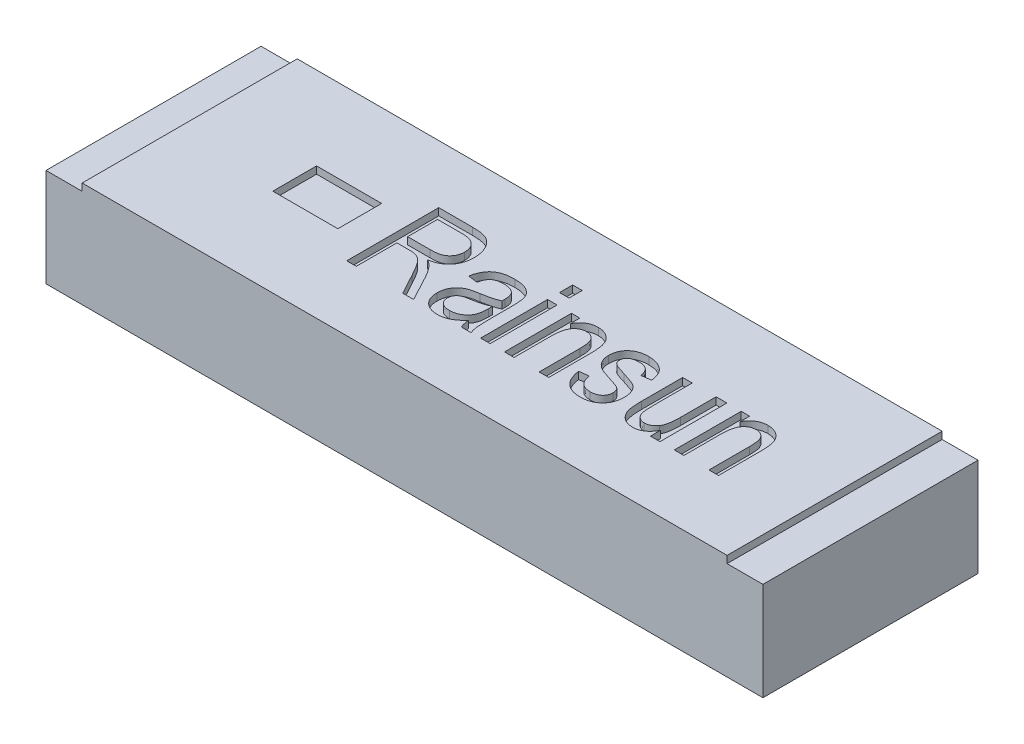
from build123d import *

# Parameters (mm, degrees)
ESQUISSE1_W             = 10
ESQUISSE1_H             = 3
BOSS_EXTRU_1_DEPTH      = 1.47
ESQUISSE2_W             = 0.907288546
ESQUISSE2_H             = 0.61051192
ENL_V_MAT_EXTRU_1_DEPTH = 0.1
ESQUISSE3_W             = 0.504272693
ESQUISSE3_H             = 3
ESQUISSE3_W_2           = 0.500030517
ENL_V_MAT_EXTRU_2_DEPTH = 0.1
ESQUISSE4_W             = 0.133419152
ESQUISSE4_H             = 0.183451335
ESQUISSE4_H_2           = 0.933934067
ENL_V_MAT_EXTRU_3_DEPTH = 0.1


with BuildPart() as part:
    # Esquisse1 → Boss.-Extru.1 (new body)
    with BuildSketch(Plane(origin=(0, 0, 0), x_dir=(1, 0, 0), z_dir=(0, 1, 0))):
        Rectangle(ESQUISSE1_W, ESQUISSE1_H)
    extrude(amount=BOSS_EXTRU_1_DEPTH)

    # Esquisse2 → Enl_v. mat.-Extru.1 (cut)
    with BuildSketch(Plane(origin=(0, 1.47, 0), x_dir=(1, 0, 0), z_dir=(0, 1, 0))):
        with Locations((-2.613912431, 0.036415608)):
            Rectangle(ESQUISSE2_W, ESQUISSE2_H)
    extrude(amount=-ENL_V_MAT_EXTRU_1_DEPTH, mode=Mode.SUBTRACT)

    # Esquisse3 → Enl_v. mat.-Extru.2 (cut)
    with BuildSketch(Plane(origin=(0, 1.47, 0), x_dir=(1, 0, 0), z_dir=(0, 1, 0))):
        with Locations((-4.747863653, 0)):
            Rectangle(ESQUISSE3_W, ESQUISSE3_H)
        with Locations((4.749984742, 0)):
            Rectangle(ESQUISSE3_W_2, ESQUISSE3_H)
    extrude(amount=-ENL_V_MAT_EXTRU_2_DEPTH, mode=Mode.SUBTRACT)

    # Esquisse4 → Enl_v. mat.-Extru.3 (cut)
    # profile 1 of 8: a face of its own
    with BuildSketch(Plane(origin=(0, 1.47, 0), x_dir=(1, 0, 0), z_dir=(0, 1, 0))):
        with BuildLine():
            Line((-1.711203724, -0.594725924), (-1.711203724, 0.689433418))
            Line((-1.711203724, 0.689433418), (-1.239546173, 0.689433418))
            add(Edge.make_bspline(
                [(-1.239546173, 0.689433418), (-1.227643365, 0.689364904), (-1.204604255, 0.689232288), (-1.171228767, 0.687324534), (-1.14019478, 0.684500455), (-1.11154364, 0.68074553), (-1.085442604, 0.675539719), (-1.061788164, 0.669224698), (-1.040387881, 0.662175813), (-1.015264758, 0.650548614), (-0.986602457, 0.632513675), (-0.955690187, 0.605036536), (-0.928613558, 0.571009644), (-0.904519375, 0.53191409), (-0.884732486, 0.488019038), (-0.870716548, 0.440148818), (-0.862255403, 0.388932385), (-0.861198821, 0.353660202), (-0.860656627, 0.335559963)],
                knots=[0, 0, 0, 0, 0.957775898, 1.853873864, 2.6892683, 3.465319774, 4.178195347, 4.829309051, 5.435011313, 5.988660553, 7.053440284, 8.147710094, 9.30058322, 10.540256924, 11.835580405, 13.162637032, 14.543981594, 16, 16, 16, 16], degree=3))
            add(Edge.make_bspline(
                [(-0.860656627, 0.335559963), (-0.860940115, 0.323565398), (-0.861493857, 0.300136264), (-0.864848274, 0.265796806), (-0.870677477, 0.233224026), (-0.879592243, 0.202502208), (-0.889931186, 0.173249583), (-0.903507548, 0.14597893), (-0.919083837, 0.120338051), (-0.937187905, 0.096530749), (-0.95743797, 0.07461011), (-0.980164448, 0.054920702), (-1.004925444, 0.037182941), (-1.031914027, 0.021552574), (-1.060963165, 0.007829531), (-1.092416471, -0.003120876), (-1.125783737, -0.012710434), (-1.148993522, -0.017108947), (-1.16084972, -0.01935583)],
                knots=[0, 0, 0, 0, 1.121977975, 2.191573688, 3.224240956, 4.211948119, 5.180998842, 6.122125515, 7.055751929, 7.983633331, 8.914994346, 9.842128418, 10.791356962, 11.759862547, 12.75578979, 13.791489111, 14.871831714, 16, 16, 16, 16], degree=3))
            add(Edge.make_bspline(
                [(-1.16084972, -0.01935583), (-1.15209864, -0.02419759), (-1.13543998, -0.033414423), (-1.112641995, -0.0482849), (-1.093158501, -0.063252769), (-1.082144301, -0.074145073), (-1.076941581, -0.079290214)],
                knots=[0, 0, 0, 0, 1.158843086, 2.205987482, 3.152571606, 4, 4, 4, 4], degree=3))
            add(Edge.make_bspline(
                [(-1.076941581, -0.079290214), (-1.066535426, -0.091850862), (-1.045606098, -0.117113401), (-1.01691532, -0.157416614), (-0.989433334, -0.199343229), (-0.973294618, -0.228836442), (-0.965150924, -0.243718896)],
                knots=[0, 0, 0, 0, 0.982253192, 1.975551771, 2.978451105, 4, 4, 4, 4], degree=3))
            Line((-0.965150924, -0.243718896), (-0.777269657, -0.594725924))
            Line((-0.777269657, -0.594725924), (-0.928929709, -0.594725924))
            Line((-0.928929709, -0.594725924), (-1.077202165, -0.320070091))
            add(Edge.make_bspline(
                [(-1.077202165, -0.320070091), (-1.084109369, -0.307191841), (-1.0973212, -0.282558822), (-1.116928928, -0.247583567), (-1.135155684, -0.216041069), (-1.151970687, -0.187900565), (-1.167623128, -0.163460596), (-1.1816813, -0.142385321), (-1.194555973, -0.124914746), (-1.209964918, -0.106914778), (-1.227875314, -0.088255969), (-1.249166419, -0.069516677), (-1.270432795, -0.054989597), (-1.292084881, -0.043926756), (-1.315919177, -0.036638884), (-1.342775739, -0.031183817), (-1.373855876, -0.028216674), (-1.395890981, -0.027875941), (-1.407623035, -0.027694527)],
                knots=[0, 0, 0, 0, 1.483643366, 2.83785556, 4.070616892, 5.1822306, 6.165666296, 7.016844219, 7.754091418, 8.367230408, 9.421242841, 10.377779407, 11.241203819, 12.029974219, 12.835959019, 13.762973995, 14.808950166, 16, 16, 16, 16], degree=3))
            Line((-1.407623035, -0.027694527), (-1.577784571, -0.027694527))
            Line((-1.577784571, -0.027694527), (-1.577784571, -0.594725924))
            Line((-1.577784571, -0.594725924), (-1.711203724, -0.594725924))
        make_face()
        with BuildLine():
            Line((-1.577784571, 0.12240202), (-1.264822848, 0.12240202))
            add(Edge.make_bspline(
                [(-1.264822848, 0.12240202), (-1.248745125, 0.122715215), (-1.218613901, 0.123302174), (-1.176460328, 0.127200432), (-1.140481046, 0.134254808), (-1.110003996, 0.144529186), (-1.084015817, 0.158143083), (-1.061389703, 0.175001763), (-1.041543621, 0.195135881), (-1.02466241, 0.21842467), (-1.010704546, 0.244359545), (-1.001284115, 0.272869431), (-0.994889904, 0.303137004), (-0.994351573, 0.324059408), (-0.994075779, 0.33477821)],
                knots=[0, 0, 0, 0, 1.47306528, 2.760668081, 3.873497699, 4.82484281, 5.696997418, 6.550136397, 7.399890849, 8.276969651, 9.17766846, 10.086208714, 11.019541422, 12, 12, 12, 12], degree=3))
            add(Edge.make_bspline(
                [(-0.994075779, 0.33477821), (-0.994316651, 0.342513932), (-0.994786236, 0.357594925), (-0.997256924, 0.379626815), (-1.002078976, 0.400359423), (-1.008441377, 0.41990416), (-1.016995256, 0.438082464), (-1.026984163, 0.455181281), (-1.039564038, 0.470497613), (-1.053253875, 0.484997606), (-1.069096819, 0.497870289), (-1.086789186, 0.50902418), (-1.106327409, 0.51839365), (-1.127523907, 0.526427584), (-1.15080889, 0.531771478), (-1.175636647, 0.53639986), (-1.202315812, 0.538965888), (-1.22069229, 0.539210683), (-1.230165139, 0.539336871)],
                knots=[0, 0, 0, 0, 1.045235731, 2.037714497, 2.988326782, 3.915852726, 4.808207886, 5.697550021, 6.58254782, 7.478674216, 8.387536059, 9.331464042, 10.296946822, 11.310355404, 12.385965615, 13.518246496, 14.720686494, 16, 16, 16, 16], degree=3))
            Line((-1.230165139, 0.539336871), (-1.577784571, 0.539336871))
            Line((-1.577784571, 0.539336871), (-1.577784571, 0.12240202))
        make_face(mode=Mode.SUBTRACT)
    # profile 2 of 8: a face of its own
    with BuildSketch(Plane(origin=(0, 1.47, 0), x_dir=(1, 0, 0), z_dir=(0, 1, 0))):
        with BuildLine():
            add(Edge.make_bspline(
                [(-0.143528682, -0.465997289), (-0.154468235, -0.477471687), (-0.175736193, -0.499779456), (-0.209803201, -0.52937873), (-0.244547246, -0.554585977), (-0.280014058, -0.575345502), (-0.316234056, -0.59134839), (-0.352977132, -0.603013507), (-0.39055834, -0.60999292), (-0.41589769, -0.610932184), (-0.428607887, -0.611403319)],
                knots=[0, 0, 0, 0, 1.153539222, 2.242634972, 3.279759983, 4.274221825, 5.22822196, 6.156113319, 7.075107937, 8, 8, 8, 8], degree=3))
            add(Edge.make_bspline(
                [(-0.428607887, -0.611403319), (-0.438435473, -0.611242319), (-0.457631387, -0.610927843), (-0.485672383, -0.607324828), (-0.512265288, -0.602103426), (-0.537233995, -0.594068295), (-0.560835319, -0.584298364), (-0.582766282, -0.571908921), (-0.603314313, -0.557550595), (-0.621971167, -0.540807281), (-0.638970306, -0.522412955), (-0.653606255, -0.502129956), (-0.666218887, -0.480450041), (-0.676425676, -0.457100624), (-0.684130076, -0.432240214), (-0.689970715, -0.405941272), (-0.69335696, -0.378096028), (-0.693705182, -0.358993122), (-0.693882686, -0.349255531)],
                knots=[0, 0, 0, 0, 1.119001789, 2.185711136, 3.216323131, 4.202252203, 5.169072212, 6.121655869, 7.066185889, 8.01954035, 8.972175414, 9.914421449, 10.863296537, 11.8249363, 12.810865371, 13.824179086, 14.890888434, 16, 16, 16, 16], degree=3))
            add(Edge.make_bspline(
                [(-0.693882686, -0.349255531), (-0.69353742, -0.336281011), (-0.692865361, -0.311026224), (-0.686023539, -0.274374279), (-0.675499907, -0.239930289), (-0.660208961, -0.208004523), (-0.641295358, -0.17897671), (-0.619104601, -0.15296628), (-0.593649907, -0.130471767), (-0.569800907, -0.114444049), (-0.548603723, -0.103328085), (-0.530619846, -0.095609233), (-0.510774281, -0.088351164), (-0.489078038, -0.081486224), (-0.465358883, -0.075657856), (-0.43972935, -0.070149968), (-0.412172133, -0.065230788), (-0.393090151, -0.062470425), (-0.383266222, -0.061049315)],
                knots=[0, 0, 0, 0, 1.315736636, 2.561069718, 3.771447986, 4.962594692, 6.141438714, 7.279577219, 8.422657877, 9.579430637, 10.186831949, 10.850275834, 11.564458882, 12.331400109, 13.159047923, 14.042804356, 14.992381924, 16, 16, 16, 16], degree=3))
            add(Edge.make_bspline(
                [(-0.383266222, -0.061049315), (-0.370047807, -0.058786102), (-0.344503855, -0.054412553), (-0.307787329, -0.046752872), (-0.27368278, -0.039022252), (-0.242451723, -0.030660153), (-0.213693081, -0.022397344), (-0.187816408, -0.013536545), (-0.164443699, -0.004645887), (-0.150258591, 0.002344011), (-0.143528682, 0.005660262)],
                knots=[0, 0, 0, 0, 1.28905306, 2.491033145, 3.605049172, 4.650122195, 5.598672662, 6.480605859, 7.279146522, 8, 8, 8, 8], degree=3))
            Line((-0.143528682, 0.005660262), (-0.143528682, 0.043705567))
            add(Edge.make_bspline(
                [(-0.143528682, 0.043705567), (-0.143584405, 0.050921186), (-0.143691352, 0.06476992), (-0.145728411, 0.084666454), (-0.148127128, 0.102996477), (-0.151939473, 0.119709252), (-0.157304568, 0.134611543), (-0.163181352, 0.14811235), (-0.170397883, 0.159944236), (-0.176349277, 0.166605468), (-0.179228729, 0.169828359)],
                knots=[0, 0, 0, 0, 1.290137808, 2.476124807, 3.574920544, 4.596386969, 5.535069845, 6.404438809, 7.22802268, 8, 8, 8, 8], degree=3))
            add(Edge.make_bspline(
                [(-0.179228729, 0.169828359), (-0.183551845, 0.174035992), (-0.192302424, 0.182552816), (-0.207658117, 0.193201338), (-0.22465146, 0.202290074), (-0.243224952, 0.209889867), (-0.263497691, 0.215667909), (-0.285535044, 0.219330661), (-0.30918883, 0.222149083), (-0.325580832, 0.222358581), (-0.334015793, 0.222466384)],
                knots=[0, 0, 0, 0, 0.860333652, 1.741433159, 2.657216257, 3.608602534, 4.602004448, 5.660502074, 6.796146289, 8, 8, 8, 8], degree=3))
            add(Edge.make_bspline(
                [(-0.334015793, 0.222466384), (-0.348817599, 0.222190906), (-0.376517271, 0.221675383), (-0.415160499, 0.214715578), (-0.448175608, 0.204251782), (-0.471476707, 0.190965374), (-0.48692811, 0.177613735), (-0.497571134, 0.165934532), (-0.507214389, 0.152197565), (-0.516075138, 0.136619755), (-0.524454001, 0.119273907), (-0.531593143, 0.099726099), (-0.538512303, 0.07850157), (-0.541991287, 0.063455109), (-0.54378614, 0.055692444)],
                knots=[0, 0, 0, 0, 1.779102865, 3.329361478, 4.707868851, 5.930643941, 6.523657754, 7.16004944, 7.827207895, 8.539060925, 9.31524689, 10.142348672, 11.041613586, 12, 12, 12, 12], degree=3))
            Line((-0.54378614, 0.055692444), (-0.677205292, 0.072369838))
            add(Edge.make_bspline(
                [(-0.677205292, 0.072369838), (-0.6746457, 0.084300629), (-0.669658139, 0.107548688), (-0.660153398, 0.141011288), (-0.648322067, 0.171891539), (-0.634906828, 0.200270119), (-0.619638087, 0.226082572), (-0.602772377, 0.249516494), (-0.58354256, 0.270061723), (-0.562850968, 0.288609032), (-0.539832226, 0.304665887), (-0.514566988, 0.318447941), (-0.486876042, 0.329827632), (-0.457150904, 0.339627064), (-0.424892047, 0.346662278), (-0.390468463, 0.352269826), (-0.353614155, 0.355303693), (-0.328287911, 0.355687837), (-0.315253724, 0.355885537)],
                knots=[0, 0, 0, 0, 1.146744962, 2.234520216, 3.265547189, 4.251500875, 5.181194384, 6.080940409, 6.959092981, 7.820811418, 8.688273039, 9.590681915, 10.520124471, 11.498613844, 12.528476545, 13.619677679, 14.774963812, 16, 16, 16, 16], degree=3))
            add(Edge.make_bspline(
                [(-0.315253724, 0.355885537), (-0.305086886, 0.35572767), (-0.285339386, 0.355421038), (-0.25655435, 0.35327447), (-0.229467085, 0.350024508), (-0.204018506, 0.345109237), (-0.180337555, 0.338453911), (-0.158077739, 0.331103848), (-0.137620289, 0.321981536), (-0.113455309, 0.307848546), (-0.086878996, 0.288215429), (-0.060184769, 0.261680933), (-0.040645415, 0.231700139), (-0.029900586, 0.204429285), (-0.024183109, 0.180956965), (-0.02023026, 0.161499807), (-0.017214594, 0.139993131), (-0.014621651, 0.116616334), (-0.012584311, 0.091327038), (-0.010957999, 0.064224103), (-0.010267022, 0.035196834), (-0.010163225, 0.015215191), (-0.01010953, 0.004878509)],
                knots=[0, 0, 0, 0, 1.116479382, 2.168587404, 3.16840818, 4.111316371, 5.011567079, 5.868311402, 6.683862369, 7.465978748, 8.938885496, 10.301521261, 11.576846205, 12.839874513, 13.499268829, 14.228894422, 15.019458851, 15.883290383, 16.811756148, 17.805505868, 18.864768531, 20, 20, 20, 20], degree=3))
            Line((-0.01010953, 0.004878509), (-0.01010953, -0.205152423))
            add(Edge.make_bspline(
                [(-0.01010953, -0.205152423), (-0.010165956, -0.222698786), (-0.010273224, -0.256055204), (-0.009554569, -0.303565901), (-0.009212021, -0.345958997), (-0.008262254, -0.38330379), (-0.007758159, -0.415546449), (-0.006280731, -0.442635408), (-0.005145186, -0.464632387), (-0.002217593, -0.496631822), (0.005573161, -0.540065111), (0.017356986, -0.576513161), (0.023245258, -0.594725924)],
                knots=[0, 0, 0, 0, 1.33924071, 2.545956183, 3.626711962, 4.574996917, 5.397345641, 6.087652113, 6.645549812, 7.078325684, 8.540065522, 10, 10, 10, 10], degree=3))
            Line((0.023245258, -0.594725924), (-0.110173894, -0.594725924))
            add(Edge.make_bspline(
                [(-0.110173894, -0.594725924), (-0.114280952, -0.585332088), (-0.12268473, -0.566110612), (-0.1318327, -0.534934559), (-0.139253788, -0.501427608), (-0.14207839, -0.478017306), (-0.143528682, -0.465997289)],
                knots=[0, 0, 0, 0, 0.920202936, 1.882900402, 2.912975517, 4, 4, 4, 4], degree=3))
        make_face()
        with BuildLine():
            add(Edge.make_bspline(
                [(-0.143528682, -0.127758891), (-0.150187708, -0.131035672), (-0.164042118, -0.137853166), (-0.186282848, -0.147228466), (-0.210815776, -0.156083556), (-0.237782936, -0.164241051), (-0.266890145, -0.172723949), (-0.298383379, -0.180425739), (-0.332115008, -0.187720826), (-0.35537379, -0.192172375), (-0.367370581, -0.194468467)],
                knots=[0, 0, 0, 0, 0.759937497, 1.581085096, 2.470290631, 3.429739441, 4.465916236, 5.57487507, 6.749129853, 8, 8, 8, 8], degree=3))
            add(Edge.make_bspline(
                [(-0.367370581, -0.194468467), (-0.380675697, -0.196633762), (-0.405196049, -0.200624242), (-0.438780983, -0.207432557), (-0.465801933, -0.215072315), (-0.487231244, -0.223244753), (-0.504266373, -0.232849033), (-0.51874445, -0.243886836), (-0.531409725, -0.25670757), (-0.541775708, -0.271407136), (-0.5501675, -0.2873274), (-0.556316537, -0.304491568), (-0.559604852, -0.322898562), (-0.560173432, -0.335519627), (-0.560463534, -0.341959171)],
                knots=[0, 0, 0, 0, 1.792080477, 3.302672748, 4.55256871, 5.521793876, 6.343933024, 7.143043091, 7.93511388, 8.729789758, 9.525220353, 10.321404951, 11.1435441, 12, 12, 12, 12], degree=3))
            add(Edge.make_bspline(
                [(-0.560463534, -0.341959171), (-0.560074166, -0.351851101), (-0.559324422, -0.37089845), (-0.550350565, -0.397752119), (-0.536790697, -0.421748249), (-0.517264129, -0.442032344), (-0.493026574, -0.458322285), (-0.464218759, -0.469679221), (-0.43147505, -0.4768459), (-0.408236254, -0.477592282), (-0.396034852, -0.477984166)],
                knots=[0, 0, 0, 0, 0.982989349, 1.89278952, 2.793465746, 3.712871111, 4.674195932, 5.684718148, 6.784373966, 8, 8, 8, 8], degree=3))
            add(Edge.make_bspline(
                [(-0.396034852, -0.477984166), (-0.384101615, -0.477623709), (-0.360571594, -0.476912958), (-0.326178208, -0.470059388), (-0.293309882, -0.459503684), (-0.262653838, -0.444260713), (-0.234600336, -0.425737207), (-0.210067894, -0.403841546), (-0.189236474, -0.379175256), (-0.175139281, -0.356030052), (-0.165820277, -0.335740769), (-0.159823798, -0.318725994), (-0.155085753, -0.300090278), (-0.150372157, -0.280014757), (-0.147554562, -0.258095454), (-0.145083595, -0.234647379), (-0.143883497, -0.209507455), (-0.14364965, -0.192210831), (-0.143528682, -0.183263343)],
                knots=[0, 0, 0, 0, 1.295816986, 2.555099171, 3.797272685, 5.038800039, 6.264426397, 7.441439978, 8.600861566, 9.761973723, 10.374641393, 11.025690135, 11.719692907, 12.46426932, 13.265486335, 14.119543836, 15.027246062, 16, 16, 16, 16], degree=3))
            Line((-0.143528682, -0.183263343), (-0.143528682, -0.127758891))
        make_face(mode=Mode.SUBTRACT)
    # profile 3 of 8: a face of its own
    with BuildSketch(Plane(origin=(0, 1.47, 0), x_dir=(1, 0, 0), z_dir=(0, 1, 0))):
        with Locations((0.223373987, 0.597707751)):
            Rectangle(ESQUISSE4_W, ESQUISSE4_H)
    # profile 4 of 8: a face of its own
    with BuildSketch(Plane(origin=(0, 1.47, 0), x_dir=(1, 0, 0), z_dir=(0, 1, 0))):
        with Locations((0.223373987, -0.12775889)):
            Rectangle(ESQUISSE4_W, ESQUISSE4_H_2)
    # profile 5 of 8: a face of its own
    with BuildSketch(Plane(origin=(0, 1.47, 0), x_dir=(1, 0, 0), z_dir=(0, 1, 0))):
        with BuildLine():
            Line((0.490212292, -0.594725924), (0.490212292, 0.339208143))
            Line((0.490212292, 0.339208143), (0.60695405, 0.339208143))
            Line((0.60695405, 0.339208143), (0.60695405, 0.20578899))
            add(Edge.make_bspline(
                [(0.60695405, 0.20578899), (0.61406544, 0.217781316), (0.627804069, 0.240949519), (0.652324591, 0.271869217), (0.679291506, 0.297829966), (0.708494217, 0.319268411), (0.740056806, 0.335971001), (0.774157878, 0.347305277), (0.81033198, 0.354632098), (0.835276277, 0.355462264), (0.847994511, 0.355885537)],
                knots=[0, 0, 0, 0, 1.116801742, 2.157570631, 3.152411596, 4.109288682, 5.053077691, 6.00219512, 6.981388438, 8, 8, 8, 8], degree=3))
            add(Edge.make_bspline(
                [(0.847994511, 0.355885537), (0.858000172, 0.355575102), (0.877676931, 0.354964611), (0.906616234, 0.350426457), (0.93436821, 0.342933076), (0.960633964, 0.332113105), (0.985089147, 0.319203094), (1.007705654, 0.304700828), (1.027130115, 0.287496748), (1.044770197, 0.268902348), (1.059714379, 0.247571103), (1.07295214, 0.223754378), (1.083360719, 0.196635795), (1.090743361, 0.172135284), (1.095621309, 0.15038025), (1.098523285, 0.131726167), (1.101626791, 0.111005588), (1.103390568, 0.088186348), (1.1054636, 0.063366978), (1.106243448, 0.036410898), (1.107168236, 0.007403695), (1.10723928, -0.01266646), (1.107275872, -0.023004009)],
                knots=[0, 0, 0, 0, 1.141513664, 2.244858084, 3.334220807, 4.4147531, 5.47892906, 6.48793521, 7.471744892, 8.432665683, 9.406385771, 10.43563962, 11.534566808, 12.713805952, 13.353541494, 14.077102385, 14.86776246, 15.743679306, 16.687940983, 17.709721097, 18.820344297, 20, 20, 20, 20], degree=3))
            Line((1.107275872, -0.023004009), (1.107275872, -0.594725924))
            Line((1.107275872, -0.594725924), (0.973856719, -0.594725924))
            Line((0.973856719, -0.594725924), (0.973856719, -0.027173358))
            add(Edge.make_bspline(
                [(0.973856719, -0.027173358), (0.973675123, -0.011187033), (0.973337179, 0.018562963), (0.970477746, 0.059782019), (0.965140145, 0.094045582), (0.957975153, 0.122248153), (0.947981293, 0.145404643), (0.935921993, 0.165356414), (0.92114596, 0.182456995), (0.904136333, 0.19680524), (0.885389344, 0.208396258), (0.864921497, 0.216510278), (0.84312684, 0.221683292), (0.828045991, 0.222202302), (0.820372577, 0.222466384)],
                knots=[0, 0, 0, 0, 1.730600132, 3.220586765, 4.468134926, 5.480892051, 6.361235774, 7.188558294, 7.99531897, 8.795973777, 9.589417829, 10.369941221, 11.170596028, 12, 12, 12, 12], degree=3))
            add(Edge.make_bspline(
                [(0.820372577, 0.222466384), (0.81306168, 0.222297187), (0.798704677, 0.221964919), (0.77782421, 0.218441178), (0.758061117, 0.212979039), (0.739451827, 0.2053407), (0.721811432, 0.195754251), (0.705627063, 0.183516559), (0.690337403, 0.169437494), (0.676540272, 0.152816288), (0.663698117, 0.13378884), (0.652923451, 0.111558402), (0.643861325, 0.086277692), (0.636300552, 0.058050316), (0.630733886, 0.026649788), (0.62664417, -0.007803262), (0.623961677, -0.045372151), (0.623744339, -0.071467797), (0.623631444, -0.085023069)],
                knots=[0, 0, 0, 0, 0.848519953, 1.666307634, 2.452162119, 3.226006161, 3.998269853, 4.777227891, 5.576824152, 6.40751938, 7.280639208, 8.237274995, 9.268282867, 10.396604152, 11.627583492, 12.969211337, 14.425669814, 16, 16, 16, 16], degree=3))
            Line((0.623631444, -0.085023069), (0.623631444, -0.594725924))
            Line((0.623631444, -0.594725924), (0.490212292, -0.594725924))
        make_face()
    # profile 6 of 8: a face of its own
    with BuildSketch(Plane(origin=(0, 1.47, 0), x_dir=(1, 0, 0), z_dir=(0, 1, 0))):
        with BuildLine():
            Line((1.240695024, -0.311210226), (1.374114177, -0.294532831))
            add(Edge.make_bspline(
                [(1.374114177, -0.294532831), (1.376371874, -0.309134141), (1.380651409, -0.336811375), (1.393510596, -0.375020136), (1.4111472, -0.407433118), (1.434135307, -0.433748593), (1.461810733, -0.453874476), (1.493697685, -0.468017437), (1.529597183, -0.476475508), (1.554824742, -0.477466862), (1.567988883, -0.477984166)],
                knots=[0, 0, 0, 0, 1.189281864, 2.254320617, 3.232274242, 4.145201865, 5.047107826, 5.968481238, 6.939921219, 8, 8, 8, 8], degree=3))
            add(Edge.make_bspline(
                [(1.567988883, -0.477984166), (1.581060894, -0.477529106), (1.605799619, -0.476667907), (1.640667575, -0.469049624), (1.671027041, -0.45643928), (1.696100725, -0.438060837), (1.716022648, -0.416069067), (1.730901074, -0.391108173), (1.739430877, -0.362910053), (1.740477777, -0.343231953), (1.741016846, -0.333099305)],
                knots=[0, 0, 0, 0, 1.234162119, 2.335646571, 3.354322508, 4.318233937, 5.248195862, 6.142280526, 7.043423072, 8, 8, 8, 8], degree=3))
            add(Edge.make_bspline(
                [(1.741016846, -0.333099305), (1.740730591, -0.3244613), (1.740185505, -0.308012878), (1.734350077, -0.284893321), (1.724714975, -0.264653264), (1.715222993, -0.25378473), (1.710528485, -0.248409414)],
                knots=[0, 0, 0, 0, 1.120009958, 2.132714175, 3.076485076, 4, 4, 4, 4], degree=3))
            add(Edge.make_bspline(
                [(1.710528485, -0.248409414), (1.708398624, -0.246614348), (1.703462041, -0.242453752), (1.694034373, -0.237026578), (1.682233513, -0.230979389), (1.667778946, -0.224725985), (1.650630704, -0.218430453), (1.631002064, -0.211215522), (1.608704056, -0.204076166), (1.592925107, -0.199308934), (1.584666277, -0.196813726)],
                knots=[0, 0, 0, 0, 0.488033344, 1.131161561, 1.901529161, 2.816272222, 3.89210763, 5.107205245, 6.485887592, 8, 8, 8, 8], degree=3))
            add(Edge.make_bspline(
                [(1.584666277, -0.196813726), (1.572494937, -0.193113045), (1.549153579, -0.186016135), (1.51573333, -0.175257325), (1.485254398, -0.165225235), (1.457786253, -0.15533877), (1.433397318, -0.14558622), (1.411633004, -0.13686609), (1.392877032, -0.128372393), (1.372219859, -0.117380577), (1.349636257, -0.102609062), (1.325789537, -0.082297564), (1.305299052, -0.059064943), (1.28794248, -0.033486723), (1.274466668, -0.005425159), (1.264331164, 0.02453576), (1.258675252, 0.056523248), (1.257811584, 0.078429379), (1.257372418, 0.0895684)],
                knots=[0, 0, 0, 0, 1.285567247, 2.465372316, 3.547942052, 4.528124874, 5.414867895, 6.202193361, 6.897424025, 7.494322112, 8.565551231, 9.617619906, 10.649836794, 11.686968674, 12.731245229, 13.786056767, 14.87423479, 16, 16, 16, 16], degree=3))
            add(Edge.make_bspline(
                [(1.257372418, 0.0895684), (1.25762462, 0.099222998), (1.258117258, 0.118081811), (1.261924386, 0.145721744), (1.267756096, 0.172052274), (1.276360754, 0.197003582), (1.287787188, 0.220246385), (1.301054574, 0.242411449), (1.317110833, 0.263087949), (1.335579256, 0.28224721), (1.356017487, 0.299780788), (1.378791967, 0.314705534), (1.403300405, 0.327507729), (1.429778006, 0.337924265), (1.458055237, 0.346025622), (1.488168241, 0.351584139), (1.520113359, 0.355486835), (1.542091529, 0.355750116), (1.553396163, 0.355885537)],
                knots=[0, 0, 0, 0, 1.030981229, 2.013867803, 2.975009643, 3.908154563, 4.825293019, 5.737112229, 6.663218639, 7.614772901, 8.57591474, 9.533242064, 10.516829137, 11.524797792, 12.56736321, 13.653765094, 14.793196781, 16, 16, 16, 16], degree=3))
            add(Edge.make_bspline(
                [(1.553396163, 0.355885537), (1.567572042, 0.355456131), (1.595174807, 0.354620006), (1.635255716, 0.348980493), (1.672664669, 0.338977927), (1.707160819, 0.325222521), (1.738571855, 0.308388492), (1.766169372, 0.288474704), (1.789892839, 0.265894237), (1.810093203, 0.240243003), (1.826497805, 0.210084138), (1.839837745, 0.174810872), (1.850826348, 0.133964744), (1.855363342, 0.10456732), (1.857758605, 0.089047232)],
                knots=[0, 0, 0, 0, 1.129175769, 2.198690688, 3.215779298, 4.206399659, 5.150677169, 6.047525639, 6.908839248, 7.7517529, 8.637509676, 9.632036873, 10.749856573, 12, 12, 12, 12], degree=3))
            Line((1.857758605, 0.089047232), (1.724339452, 0.072369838))
            add(Edge.make_bspline(
                [(1.724339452, 0.072369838), (1.722511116, 0.084166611), (1.719036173, 0.106587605), (1.708692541, 0.137725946), (1.693617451, 0.163881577), (1.674808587, 0.185835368), (1.651269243, 0.202417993), (1.623778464, 0.214249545), (1.592225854, 0.221308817), (1.569851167, 0.222067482), (1.55808668, 0.222466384)],
                knots=[0, 0, 0, 0, 1.1431212, 2.172620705, 3.123755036, 4.020570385, 4.921665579, 5.857517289, 6.873494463, 8, 8, 8, 8], degree=3))
            add(Edge.make_bspline(
                [(1.55808668, 0.222466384), (1.544855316, 0.222109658), (1.520062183, 0.22144122), (1.485492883, 0.21547045), (1.45596182, 0.205929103), (1.432025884, 0.191694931), (1.413671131, 0.174236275), (1.400449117, 0.154404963), (1.39215467, 0.132146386), (1.391253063, 0.116393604), (1.390791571, 0.108330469)],
                knots=[0, 0, 0, 0, 1.395580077, 2.6150593, 3.690777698, 4.653104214, 5.528564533, 6.342314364, 7.151505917, 8, 8, 8, 8], degree=3))
            add(Edge.make_bspline(
                [(1.390791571, 0.108330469), (1.391233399, 0.100516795), (1.392098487, 0.085217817), (1.400677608, 0.063903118), (1.414143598, 0.044986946), (1.426539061, 0.035582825), (1.433006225, 0.030676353)],
                knots=[0, 0, 0, 0, 1.01333812, 1.98409065, 2.948226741, 4, 4, 4, 4], degree=3))
            add(Edge.make_bspline(
                [(1.433006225, 0.030676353), (1.435592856, 0.029163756), (1.441669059, 0.025610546), (1.452666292, 0.020523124), (1.466763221, 0.01481743), (1.483974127, 0.008730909), (1.504118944, 0.001500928), (1.527513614, -0.005800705), (1.553914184, -0.014348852), (1.572664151, -0.019839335), (1.582581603, -0.022743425)],
                knots=[0, 0, 0, 0, 0.451775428, 1.061256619, 1.825217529, 2.745334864, 3.814398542, 5.053265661, 6.441378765, 8, 8, 8, 8], degree=3))
            add(Edge.make_bspline(
                [(1.582581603, -0.022743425), (1.59545219, -0.02660342), (1.619952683, -0.03395132), (1.654691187, -0.045196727), (1.685721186, -0.055843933), (1.713038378, -0.065918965), (1.736624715, -0.07551157), (1.756363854, -0.084704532), (1.772762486, -0.0927136), (1.789070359, -0.103624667), (1.806067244, -0.11799386), (1.823760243, -0.137484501), (1.838920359, -0.159888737), (1.85171178, -0.185004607), (1.861743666, -0.212776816), (1.869521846, -0.242915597), (1.873441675, -0.275755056), (1.874096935, -0.298433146), (1.874435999, -0.310167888)],
                knots=[0, 0, 0, 0, 1.4208324, 2.704701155, 3.860775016, 4.889580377, 5.783364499, 6.551894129, 7.192743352, 7.709885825, 8.62249147, 9.539385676, 10.484551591, 11.474534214, 12.511954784, 13.601300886, 14.758796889, 16, 16, 16, 16], degree=3))
            add(Edge.make_bspline(
                [(1.874435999, -0.310167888), (1.874188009, -0.32112239), (1.873702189, -0.342582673), (1.869825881, -0.374031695), (1.862889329, -0.403787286), (1.854001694, -0.432143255), (1.84171752, -0.458653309), (1.827242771, -0.483744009), (1.809821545, -0.507070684), (1.79007044, -0.528707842), (1.767962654, -0.548179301), (1.743934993, -0.565283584), (1.7177664, -0.579379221), (1.689793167, -0.591196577), (1.659726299, -0.600247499), (1.627801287, -0.606713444), (1.593975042, -0.610710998), (1.570779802, -0.61116842), (1.558868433, -0.611403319)],
                knots=[0, 0, 0, 0, 1.067785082, 2.091831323, 3.081950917, 4.043300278, 4.98307574, 5.924185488, 6.862433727, 7.815392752, 8.775286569, 9.729148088, 10.68406144, 11.666985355, 12.684886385, 13.739427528, 14.839136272, 16, 16, 16, 16], degree=3))
            add(Edge.make_bspline(
                [(1.558868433, -0.611403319), (1.547743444, -0.611115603), (1.526049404, -0.610554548), (1.494282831, -0.607272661), (1.464427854, -0.601198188), (1.4361523, -0.59322752), (1.409944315, -0.582481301), (1.385293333, -0.56966577), (1.362716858, -0.554181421), (1.341549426, -0.536678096), (1.322644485, -0.516452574), (1.305182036, -0.494153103), (1.289968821, -0.46930557), (1.276251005, -0.442250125), (1.264660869, -0.412800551), (1.254790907, -0.380986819), (1.246322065, -0.347004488), (1.242598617, -0.323319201), (1.240695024, -0.311210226)],
                knots=[0, 0, 0, 0, 1.0975712, 2.140294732, 3.145156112, 4.099659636, 5.033637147, 5.934321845, 6.835006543, 7.729105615, 8.638227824, 9.560299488, 10.518487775, 11.507108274, 12.549268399, 13.63594966, 14.791392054, 16, 16, 16, 16], degree=3))
        make_face()
    # profile 7 of 8: a face of its own
    with BuildSketch(Plane(origin=(0, 1.47, 0), x_dir=(1, 0, 0), z_dir=(0, 1, 0))):
        with BuildLine():
            Line((2.524854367, -0.594725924), (2.524854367, -0.456095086))
            add(Edge.make_bspline(
                [(2.524854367, -0.456095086), (2.517642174, -0.468421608), (2.503731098, -0.492197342), (2.479337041, -0.524051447), (2.452837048, -0.550860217), (2.424591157, -0.573091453), (2.394236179, -0.590213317), (2.362070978, -0.602655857), (2.327850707, -0.610165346), (2.304350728, -0.610986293), (2.292413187, -0.611403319)],
                knots=[0, 0, 0, 0, 1.162811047, 2.242861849, 3.258749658, 4.227055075, 5.161937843, 6.087208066, 7.028338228, 8, 8, 8, 8], degree=3))
            add(Edge.make_bspline(
                [(2.292413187, -0.611403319), (2.278464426, -0.610812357), (2.25120969, -0.609657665), (2.211959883, -0.600350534), (2.175858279, -0.584978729), (2.143282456, -0.563934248), (2.115320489, -0.537746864), (2.091741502, -0.508364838), (2.073487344, -0.475598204), (2.060643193, -0.438867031), (2.051662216, -0.397363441), (2.045785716, -0.349742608), (2.041816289, -0.295468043), (2.041419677, -0.257016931), (2.041209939, -0.236683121)],
                knots=[0, 0, 0, 0, 0.975841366, 1.906714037, 2.805934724, 3.711835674, 4.607016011, 5.477071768, 6.340127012, 7.219317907, 8.191684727, 9.308178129, 10.576504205, 12, 12, 12, 12], degree=3))
            Line((2.041209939, -0.236683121), (2.041209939, 0.339208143))
            Line((2.041209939, 0.339208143), (2.174629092, 0.339208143))
            Line((2.174629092, 0.339208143), (2.174629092, -0.177791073))
            add(Edge.make_bspline(
                [(2.174629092, -0.177791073), (2.174699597, -0.189256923), (2.174834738, -0.21123427), (2.175287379, -0.24277029), (2.176268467, -0.271358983), (2.177901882, -0.296891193), (2.179593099, -0.319504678), (2.181986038, -0.339128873), (2.184391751, -0.355880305), (2.188565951, -0.373859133), (2.195159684, -0.393526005), (2.206767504, -0.414214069), (2.220188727, -0.433167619), (2.236973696, -0.448940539), (2.255743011, -0.461717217), (2.275901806, -0.471284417), (2.297490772, -0.476975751), (2.312271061, -0.477644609), (2.319774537, -0.477984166)],
                knots=[0, 0, 0, 0, 1.461737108, 2.801807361, 4.02069174, 5.107921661, 6.063387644, 6.910850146, 7.628149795, 8.219102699, 9.262712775, 10.258707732, 11.23323409, 12.212279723, 13.176687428, 14.117930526, 15.044534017, 16, 16, 16, 16], degree=3))
            add(Edge.make_bspline(
                [(2.319774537, -0.477984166), (2.326821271, -0.477694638), (2.340648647, -0.477126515), (2.36093446, -0.47380918), (2.380148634, -0.467651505), (2.398461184, -0.459306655), (2.415886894, -0.448547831), (2.431936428, -0.435077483), (2.44736923, -0.419574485), (2.456367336, -0.407740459), (2.461011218, -0.401632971)],
                knots=[0, 0, 0, 0, 1.011738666, 1.985272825, 2.939456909, 3.899001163, 4.867653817, 5.868503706, 6.899944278, 8, 8, 8, 8], degree=3))
            add(Edge.make_bspline(
                [(2.461011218, -0.401632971), (2.464813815, -0.39563773), (2.472849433, -0.382968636), (2.482305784, -0.361084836), (2.490258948, -0.335902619), (2.497021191, -0.307431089), (2.502140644, -0.27546604), (2.505680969, -0.240139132), (2.507709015, -0.201354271), (2.508016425, -0.174405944), (2.508176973, -0.160331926)],
                knots=[0, 0, 0, 0, 0.683097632, 1.44351622, 2.287677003, 3.225364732, 4.259872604, 5.403917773, 6.644171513, 8, 8, 8, 8], degree=3))
            Line((2.508176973, -0.160331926), (2.508176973, 0.339208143))
            Line((2.508176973, 0.339208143), (2.658273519, 0.339208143))
            Line((2.658273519, 0.339208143), (2.658273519, -0.594725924))
            Line((2.658273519, -0.594725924), (2.524854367, -0.594725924))
        make_face()
    # profile 8 of 8: a face of its own
    with BuildSketch(Plane(origin=(0, 1.47, 0), x_dir=(1, 0, 0), z_dir=(0, 1, 0))):
        with BuildLine():
            Line((2.858402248, -0.594725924), (2.858402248, 0.339208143))
            Line((2.858402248, 0.339208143), (2.975144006, 0.339208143))
            Line((2.975144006, 0.339208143), (2.975144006, 0.20578899))
            add(Edge.make_bspline(
                [(2.975144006, 0.20578899), (2.982255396, 0.217781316), (2.995994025, 0.240949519), (3.020514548, 0.271869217), (3.047481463, 0.297829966), (3.076684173, 0.319268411), (3.108246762, 0.335971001), (3.142347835, 0.347305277), (3.178521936, 0.354632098), (3.203466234, 0.355462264), (3.216184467, 0.355885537)],
                knots=[0, 0, 0, 0, 1.116801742, 2.157570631, 3.152411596, 4.109288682, 5.053077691, 6.00219512, 6.981388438, 8, 8, 8, 8], degree=3))
            add(Edge.make_bspline(
                [(3.216184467, 0.355885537), (3.226190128, 0.355575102), (3.245866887, 0.354964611), (3.274806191, 0.350426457), (3.302558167, 0.342933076), (3.32882392, 0.332113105), (3.353279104, 0.319203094), (3.37589561, 0.304700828), (3.395320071, 0.287496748), (3.412960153, 0.268902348), (3.427904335, 0.247571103), (3.441142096, 0.223754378), (3.451550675, 0.196635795), (3.458933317, 0.172135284), (3.463811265, 0.15038025), (3.466713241, 0.131726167), (3.469816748, 0.111005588), (3.471580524, 0.088186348), (3.473653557, 0.063366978), (3.474433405, 0.036410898), (3.475358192, 0.007403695), (3.475429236, -0.01266646), (3.475465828, -0.023004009)],
                knots=[0, 0, 0, 0, 1.141513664, 2.244858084, 3.334220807, 4.4147531, 5.47892906, 6.48793521, 7.471744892, 8.432665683, 9.406385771, 10.43563962, 11.534566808, 12.713805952, 13.353541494, 14.077102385, 14.86776246, 15.743679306, 16.687940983, 17.709721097, 18.820344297, 20, 20, 20, 20], degree=3))
            Line((3.475465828, -0.023004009), (3.475465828, -0.594725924))
            Line((3.475465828, -0.594725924), (3.342046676, -0.594725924))
            Line((3.342046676, -0.594725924), (3.342046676, -0.027173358))
            add(Edge.make_bspline(
                [(3.342046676, -0.027173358), (3.34186508, -0.011187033), (3.341527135, 0.018562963), (3.338667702, 0.059782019), (3.333330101, 0.094045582), (3.326165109, 0.122248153), (3.316171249, 0.145404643), (3.304111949, 0.165356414), (3.289335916, 0.182456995), (3.27232629, 0.19680524), (3.2535793, 0.208396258), (3.233111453, 0.216510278), (3.211316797, 0.221683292), (3.196235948, 0.222202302), (3.188562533, 0.222466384)],
                knots=[0, 0, 0, 0, 1.730600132, 3.220586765, 4.468134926, 5.480892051, 6.361235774, 7.188558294, 7.99531897, 8.795973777, 9.589417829, 10.369941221, 11.170596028, 12, 12, 12, 12], degree=3))
            add(Edge.make_bspline(
                [(3.188562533, 0.222466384), (3.181251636, 0.222297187), (3.166894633, 0.221964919), (3.146014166, 0.218441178), (3.126251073, 0.212979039), (3.107641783, 0.2053407), (3.090001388, 0.195754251), (3.073817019, 0.183516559), (3.058527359, 0.169437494), (3.044730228, 0.152816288), (3.031888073, 0.13378884), (3.021113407, 0.111558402), (3.012051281, 0.086277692), (3.004490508, 0.058050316), (2.998923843, 0.026649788), (2.994834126, -0.007803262), (2.992151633, -0.045372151), (2.991934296, -0.071467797), (2.9918214, -0.085023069)],
                knots=[0, 0, 0, 0, 0.848519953, 1.666307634, 2.452162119, 3.226006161, 3.998269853, 4.777227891, 5.576824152, 6.40751938, 7.280639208, 8.237274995, 9.268282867, 10.396604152, 11.627583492, 12.969211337, 14.425669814, 16, 16, 16, 16], degree=3))
            Line((2.9918214, -0.085023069), (2.9918214, -0.594725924))
            Line((2.9918214, -0.594725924), (2.858402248, -0.594725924))
        make_face()
    extrude(amount=-ENL_V_MAT_EXTRU_3_DEPTH, mode=Mode.SUBTRACT)


solid = part.part
